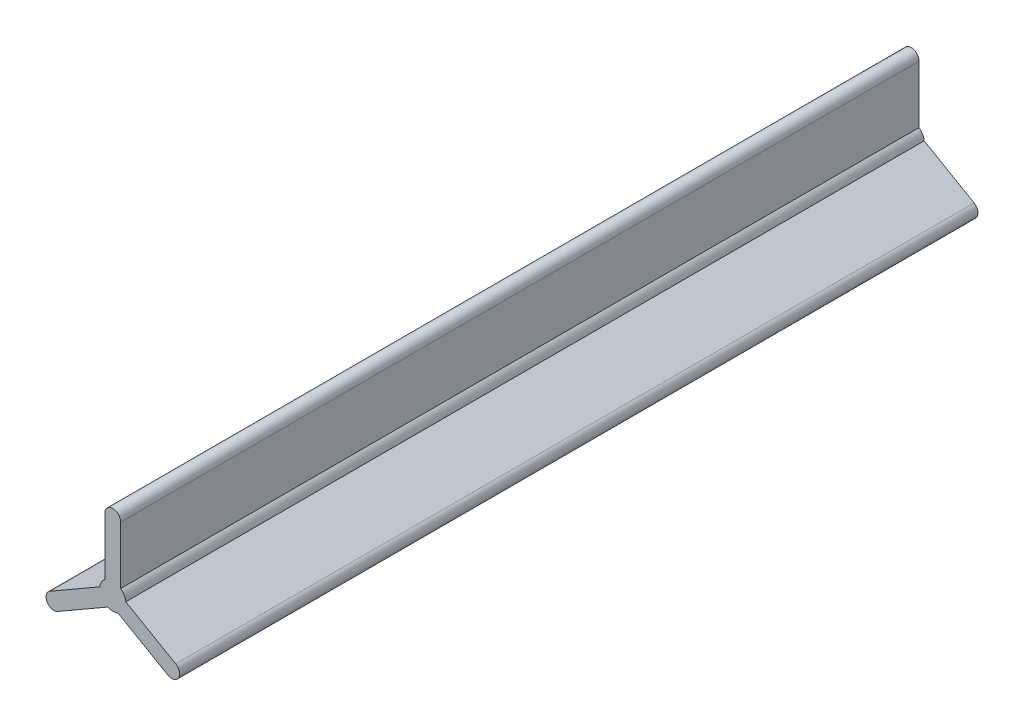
ISO-10303-21;
HEADER;
FILE_DESCRIPTION(('STEP AP214'),'2;1');
FILE_NAME('part.step','',(''),(''),'','','');
FILE_SCHEMA(('AUTOMOTIVE_DESIGN { 1 0 10303 214 1 1 1 1 }'));
ENDSEC;
DATA;
#1=APPLICATION_CONTEXT('core data for automotive mechanical design processes');
#2=APPLICATION_PROTOCOL_DEFINITION('international standard','automotive_design',2000,#1);
#3=PRODUCT_CONTEXT('',#1,'mechanical');
#4=PRODUCT('Part','Part','',(#3));
#5=PRODUCT_RELATED_PRODUCT_CATEGORY('part','',(#4));
#6=PRODUCT_DEFINITION_FORMATION('','',#4);
#7=PRODUCT_DEFINITION_CONTEXT('part definition',#1,'design');
#8=PRODUCT_DEFINITION('design','',#6,#7);
#9=PRODUCT_DEFINITION_SHAPE('','',#8);
#10=(LENGTH_UNIT() NAMED_UNIT(*) SI_UNIT(.MILLI.,.METRE.));
#11=(NAMED_UNIT(*) PLANE_ANGLE_UNIT() SI_UNIT($,.RADIAN.));
#12=(NAMED_UNIT(*) SI_UNIT($,.STERADIAN.) SOLID_ANGLE_UNIT());
#13=UNCERTAINTY_MEASURE_WITH_UNIT(LENGTH_MEASURE(1.E-05),#10,'distance_accuracy_value','');
#14=(GEOMETRIC_REPRESENTATION_CONTEXT(3) GLOBAL_UNCERTAINTY_ASSIGNED_CONTEXT((#13)) GLOBAL_UNIT_ASSIGNED_CONTEXT((#10,
#11,#12)) REPRESENTATION_CONTEXT('',''));
#15=CARTESIAN_POINT('',(0.,0.,0.));
#16=DIRECTION('',(0.,0.,1.));
#17=DIRECTION('',(1.,0.,0.));
#18=AXIS2_PLACEMENT_3D('',#15,#16,#17);
#19=CARTESIAN_POINT('',(0.,0.,305.));
#20=DIRECTION('',(0.,0.,-1.));
#21=DIRECTION('',(-1.,0.,0.));
#22=AXIS2_PLACEMENT_3D('',#19,#20,#21);
#23=CYLINDRICAL_SURFACE('',#22,10.);
#24=DIRECTION('',(0.,0.,-1.));
#25=VECTOR('',#24,1.);
#26=CARTESIAN_POINT('',(9.9282032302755,1.19615242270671,305.));
#27=LINE('',#26,#25);
#28=CARTESIAN_POINT('',(9.9282032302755,1.19615242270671,305.));
#29=VERTEX_POINT('',#28);
#30=CARTESIAN_POINT('',(9.9282032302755,1.19615242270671,-305.));
#31=VERTEX_POINT('',#30);
#32=EDGE_CURVE('E137',#29,#31,#27,.T.);
#33=ORIENTED_EDGE('',*,*,#32,.T.);
#34=CARTESIAN_POINT('',(0.,0.,-305.));
#35=DIRECTION('',(0.,0.,1.));
#36=DIRECTION('',(1.,0.,0.));
#37=AXIS2_PLACEMENT_3D('',#34,#35,#36);
#38=CIRCLE('',#37,10.);
#39=CARTESIAN_POINT('',(5.99999999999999,8.,-305.));
#40=VERTEX_POINT('',#39);
#41=EDGE_CURVE('E237',#31,#40,#38,.T.);
#42=ORIENTED_EDGE('',*,*,#41,.T.);
#43=DIRECTION('',(0.,0.,-1.));
#44=VECTOR('',#43,1.);
#45=CARTESIAN_POINT('',(5.99999999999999,8.00000000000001,305.));
#46=LINE('',#45,#44);
#47=CARTESIAN_POINT('',(5.99999999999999,8.,305.));
#48=VERTEX_POINT('',#47);
#49=EDGE_CURVE('E226',#48,#40,#46,.T.);
#50=ORIENTED_EDGE('',*,*,#49,.F.);
#51=CARTESIAN_POINT('',(0.,0.,305.));
#52=DIRECTION('',(0.,0.,1.));
#53=DIRECTION('',(1.,0.,0.));
#54=AXIS2_PLACEMENT_3D('',#51,#52,#53);
#55=CIRCLE('',#54,10.);
#56=EDGE_CURVE('E49',#29,#48,#55,.T.);
#57=ORIENTED_EDGE('',*,*,#56,.F.);
#58=EDGE_LOOP('',(#33,#42,#50,#57));
#59=FACE_BOUND('',#58,.T.);
#60=ADVANCED_FACE('F39',(#59),#23,.T.);
#61=DIRECTION('',(0.,0.,-1.));
#62=VECTOR('',#61,1.);
#63=CARTESIAN_POINT('',(3.9282032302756,-9.19615242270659,305.));
#64=LINE('',#63,#62);
#65=CARTESIAN_POINT('',(3.9282032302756,-9.19615242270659,305.));
#66=VERTEX_POINT('',#65);
#67=CARTESIAN_POINT('',(3.9282032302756,-9.19615242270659,-305.));
#68=VERTEX_POINT('',#67);
#69=EDGE_CURVE('E63',#66,#68,#64,.T.);
#70=ORIENTED_EDGE('',*,*,#69,.F.);
#71=CARTESIAN_POINT('',(-3.92820323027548,-9.19615242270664,305.));
#72=VERTEX_POINT('',#71);
#73=EDGE_CURVE('E48',#72,#66,#55,.T.);
#74=ORIENTED_EDGE('',*,*,#73,.F.);
#75=DIRECTION('',(0.,0.,-1.));
#76=VECTOR('',#75,1.);
#77=CARTESIAN_POINT('',(-3.92820323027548,-9.19615242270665,305.));
#78=LINE('',#77,#76);
#79=CARTESIAN_POINT('',(-3.92820323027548,-9.19615242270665,-305.));
#80=VERTEX_POINT('',#79);
#81=EDGE_CURVE('E193',#72,#80,#78,.T.);
#82=ORIENTED_EDGE('',*,*,#81,.T.);
#83=EDGE_CURVE('E241',#80,#68,#38,.T.);
#84=ORIENTED_EDGE('',*,*,#83,.T.);
#85=EDGE_LOOP('',(#70,#74,#82,#84));
#86=FACE_BOUND('',#85,.T.);
#87=ADVANCED_FACE('F268',(#86),#23,.T.);
#88=DIRECTION('',(0.,0.,-1.));
#89=VECTOR('',#88,1.);
#90=CARTESIAN_POINT('',(-9.92820323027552,1.19615242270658,305.));
#91=LINE('',#90,#89);
#92=CARTESIAN_POINT('',(-9.92820323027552,1.19615242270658,305.));
#93=VERTEX_POINT('',#92);
#94=CARTESIAN_POINT('',(-9.92820323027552,1.19615242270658,-305.));
#95=VERTEX_POINT('',#94);
#96=EDGE_CURVE('E189',#93,#95,#91,.T.);
#97=ORIENTED_EDGE('',*,*,#96,.F.);
#98=CARTESIAN_POINT('',(-5.99999999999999,8.00000000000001,305.));
#99=VERTEX_POINT('',#98);
#100=EDGE_CURVE('E11',#99,#93,#55,.T.);
#101=ORIENTED_EDGE('',*,*,#100,.F.);
#102=DIRECTION('',(0.,0.,-1.));
#103=VECTOR('',#102,1.);
#104=CARTESIAN_POINT('',(-5.99999999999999,8.00000000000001,305.));
#105=LINE('',#104,#103);
#106=CARTESIAN_POINT('',(-5.99999999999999,8.00000000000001,-305.));
#107=VERTEX_POINT('',#106);
#108=EDGE_CURVE('E230',#99,#107,#105,.T.);
#109=ORIENTED_EDGE('',*,*,#108,.T.);
#110=EDGE_CURVE('E42',#107,#95,#38,.T.);
#111=ORIENTED_EDGE('',*,*,#110,.T.);
#112=EDGE_LOOP('',(#97,#101,#109,#111));
#113=FACE_BOUND('',#112,.T.);
#114=ADVANCED_FACE('F269',(#113),#23,.T.);
#115=CARTESIAN_POINT('',(0.,0.,305.));
#116=DIRECTION('',(0.,0.,1.));
#117=DIRECTION('',(1.,0.,0.));
#118=AXIS2_PLACEMENT_3D('',#115,#116,#117);
#119=PLANE('',#118);
#120=ORIENTED_EDGE('',*,*,#73,.T.);
#121=DIRECTION('',(0.866025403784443,-0.499999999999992,0.));
#122=VECTOR('',#121,1.);
#123=CARTESIAN_POINT('',(3.9282032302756,-9.19615242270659,305.));
#124=LINE('',#123,#122);
#125=CARTESIAN_POINT('',(42.0333209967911,-31.1961524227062,305.));
#126=VERTEX_POINT('',#125);
#127=EDGE_CURVE('E140',#66,#126,#124,.T.);
#128=ORIENTED_EDGE('',*,*,#127,.T.);
#129=CARTESIAN_POINT('',(45.0333209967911,-25.9999999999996,305.));
#130=DIRECTION('',(0.,0.,1.));
#131=DIRECTION('',(-0.499999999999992,-0.866025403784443,0.));
#132=AXIS2_PLACEMENT_3D('',#129,#130,#131);
#133=CIRCLE('',#132,6.);
#134=CARTESIAN_POINT('',(48.033320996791,-20.8038475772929,305.));
#135=VERTEX_POINT('',#134);
#136=EDGE_CURVE('E141',#126,#135,#133,.T.);
#137=ORIENTED_EDGE('',*,*,#136,.T.);
#138=DIRECTION('',(-0.866025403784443,0.499999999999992,0.));
#139=VECTOR('',#138,1.);
#140=CARTESIAN_POINT('',(48.033320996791,-20.8038475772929,305.));
#141=LINE('',#140,#139);
#142=EDGE_CURVE('E130',#135,#29,#141,.T.);
#143=ORIENTED_EDGE('',*,*,#142,.T.);
#144=ORIENTED_EDGE('',*,*,#56,.T.);
#145=DIRECTION('',(0.,1.,0.));
#146=VECTOR('',#145,1.);
#147=CARTESIAN_POINT('',(5.99999999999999,8.00000000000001,305.));
#148=LINE('',#147,#146);
#149=CARTESIAN_POINT('',(6.,52.,305.));
#150=VERTEX_POINT('',#149);
#151=EDGE_CURVE('E211',#48,#150,#148,.T.);
#152=ORIENTED_EDGE('',*,*,#151,.T.);
#153=CARTESIAN_POINT('',(0.,52.,305.));
#154=DIRECTION('',(0.,0.,1.));
#155=DIRECTION('',(1.,0.,0.));
#156=AXIS2_PLACEMENT_3D('',#153,#154,#155);
#157=CIRCLE('',#156,6.);
#158=CARTESIAN_POINT('',(-6.,52.,305.));
#159=VERTEX_POINT('',#158);
#160=EDGE_CURVE('E202',#150,#159,#157,.T.);
#161=ORIENTED_EDGE('',*,*,#160,.T.);
#162=DIRECTION('',(0.,-1.,0.));
#163=VECTOR('',#162,1.);
#164=CARTESIAN_POINT('',(-6.,52.,305.));
#165=LINE('',#164,#163);
#166=EDGE_CURVE('E206',#159,#99,#165,.T.);
#167=ORIENTED_EDGE('',*,*,#166,.T.);
#168=ORIENTED_EDGE('',*,*,#100,.T.);
#169=DIRECTION('',(-0.866025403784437,-0.500000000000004,0.));
#170=VECTOR('',#169,1.);
#171=CARTESIAN_POINT('',(-9.92820323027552,1.19615242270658,305.));
#172=LINE('',#171,#170);
#173=CARTESIAN_POINT('',(-48.0333209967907,-20.8038475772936,305.));
#174=VERTEX_POINT('',#173);
#175=EDGE_CURVE('E177',#93,#174,#172,.T.);
#176=ORIENTED_EDGE('',*,*,#175,.T.);
#177=CARTESIAN_POINT('',(-45.0333209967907,-26.0000000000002,305.));
#178=DIRECTION('',(0.,0.,1.));
#179=DIRECTION('',(-0.500000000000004,0.866025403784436,0.));
#180=AXIS2_PLACEMENT_3D('',#177,#178,#179);
#181=CIRCLE('',#180,6.);
#182=CARTESIAN_POINT('',(-42.0333209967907,-31.1961524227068,305.));
#183=VERTEX_POINT('',#182);
#184=EDGE_CURVE('E168',#174,#183,#181,.T.);
#185=ORIENTED_EDGE('',*,*,#184,.T.);
#186=DIRECTION('',(0.866025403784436,0.500000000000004,0.));
#187=VECTOR('',#186,1.);
#188=CARTESIAN_POINT('',(-42.0333209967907,-31.1961524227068,305.));
#189=LINE('',#188,#187);
#190=EDGE_CURVE('E172',#183,#72,#189,.T.);
#191=ORIENTED_EDGE('',*,*,#190,.T.);
#192=EDGE_LOOP('',(#120,#128,#137,#143,#144,#152,#161,#167,#168,#176,#185,#191));
#193=FACE_BOUND('',#192,.T.);
#194=ADVANCED_FACE('F144',(#193),#119,.T.);
#195=CARTESIAN_POINT('',(0.,0.,-305.));
#196=DIRECTION('',(0.,0.,1.));
#197=DIRECTION('',(1.,0.,0.));
#198=AXIS2_PLACEMENT_3D('',#195,#196,#197);
#199=PLANE('',#198);
#200=ORIENTED_EDGE('',*,*,#41,.F.);
#201=DIRECTION('',(-0.866025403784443,0.499999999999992,0.));
#202=VECTOR('',#201,1.);
#203=CARTESIAN_POINT('',(48.033320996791,-20.8038475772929,-305.));
#204=LINE('',#203,#202);
#205=CARTESIAN_POINT('',(48.033320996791,-20.8038475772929,-305.));
#206=VERTEX_POINT('',#205);
#207=EDGE_CURVE('E258',#206,#31,#204,.T.);
#208=ORIENTED_EDGE('',*,*,#207,.F.);
#209=CARTESIAN_POINT('',(45.0333209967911,-25.9999999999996,-305.));
#210=DIRECTION('',(0.,0.,1.));
#211=DIRECTION('',(-0.499999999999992,-0.866025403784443,0.));
#212=AXIS2_PLACEMENT_3D('',#209,#210,#211);
#213=CIRCLE('',#212,6.);
#214=CARTESIAN_POINT('',(42.0333209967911,-31.1961524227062,-305.));
#215=VERTEX_POINT('',#214);
#216=EDGE_CURVE('E154',#215,#206,#213,.T.);
#217=ORIENTED_EDGE('',*,*,#216,.F.);
#218=DIRECTION('',(0.866025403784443,-0.499999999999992,0.));
#219=VECTOR('',#218,1.);
#220=CARTESIAN_POINT('',(3.9282032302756,-9.19615242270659,-305.));
#221=LINE('',#220,#219);
#222=EDGE_CURVE('E150',#68,#215,#221,.T.);
#223=ORIENTED_EDGE('',*,*,#222,.F.);
#224=ORIENTED_EDGE('',*,*,#83,.F.);
#225=DIRECTION('',(0.866025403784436,0.500000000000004,0.));
#226=VECTOR('',#225,1.);
#227=CARTESIAN_POINT('',(-42.0333209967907,-31.1961524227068,-305.));
#228=LINE('',#227,#226);
#229=CARTESIAN_POINT('',(-42.0333209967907,-31.1961524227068,-305.));
#230=VERTEX_POINT('',#229);
#231=EDGE_CURVE('E162',#230,#80,#228,.T.);
#232=ORIENTED_EDGE('',*,*,#231,.F.);
#233=CARTESIAN_POINT('',(-45.0333209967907,-26.0000000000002,-305.));
#234=DIRECTION('',(0.,0.,1.));
#235=DIRECTION('',(-0.500000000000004,0.866025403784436,0.));
#236=AXIS2_PLACEMENT_3D('',#233,#234,#235);
#237=CIRCLE('',#236,6.);
#238=CARTESIAN_POINT('',(-48.0333209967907,-20.8038475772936,-305.));
#239=VERTEX_POINT('',#238);
#240=EDGE_CURVE('E156',#239,#230,#237,.T.);
#241=ORIENTED_EDGE('',*,*,#240,.F.);
#242=DIRECTION('',(-0.866025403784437,-0.500000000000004,0.));
#243=VECTOR('',#242,1.);
#244=CARTESIAN_POINT('',(-9.92820323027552,1.19615242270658,-305.));
#245=LINE('',#244,#243);
#246=EDGE_CURVE('E173',#95,#239,#245,.T.);
#247=ORIENTED_EDGE('',*,*,#246,.F.);
#248=ORIENTED_EDGE('',*,*,#110,.F.);
#249=DIRECTION('',(0.,-1.,0.));
#250=VECTOR('',#249,1.);
#251=CARTESIAN_POINT('',(-6.,52.,-305.));
#252=LINE('',#251,#250);
#253=CARTESIAN_POINT('',(-6.,52.,-305.));
#254=VERTEX_POINT('',#253);
#255=EDGE_CURVE('E217',#254,#107,#252,.T.);
#256=ORIENTED_EDGE('',*,*,#255,.F.);
#257=CARTESIAN_POINT('',(0.,52.,-305.));
#258=DIRECTION('',(0.,0.,1.));
#259=DIRECTION('',(1.,0.,0.));
#260=AXIS2_PLACEMENT_3D('',#257,#258,#259);
#261=CIRCLE('',#260,6.);
#262=CARTESIAN_POINT('',(6.,52.,-305.));
#263=VERTEX_POINT('',#262);
#264=EDGE_CURVE('E201',#263,#254,#261,.T.);
#265=ORIENTED_EDGE('',*,*,#264,.F.);
#266=DIRECTION('',(0.,1.,0.));
#267=VECTOR('',#266,1.);
#268=CARTESIAN_POINT('',(5.99999999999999,8.00000000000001,-305.));
#269=LINE('',#268,#267);
#270=EDGE_CURVE('E207',#40,#263,#269,.T.);
#271=ORIENTED_EDGE('',*,*,#270,.F.);
#272=EDGE_LOOP('',(#200,#208,#217,#223,#224,#232,#241,#247,#248,#256,#265,#271));
#273=FACE_BOUND('',#272,.T.);
#274=ADVANCED_FACE('F264',(#273),#199,.F.);
#275=CARTESIAN_POINT('',(0.,52.,305.));
#276=DIRECTION('',(0.,0.,-1.));
#277=DIRECTION('',(-1.,0.,0.));
#278=AXIS2_PLACEMENT_3D('',#275,#276,#277);
#279=CYLINDRICAL_SURFACE('',#278,6.);
#280=ORIENTED_EDGE('',*,*,#264,.T.);
#281=DIRECTION('',(0.,0.,-1.));
#282=VECTOR('',#281,1.);
#283=CARTESIAN_POINT('',(-6.,52.,305.));
#284=LINE('',#283,#282);
#285=EDGE_CURVE('E234',#159,#254,#284,.T.);
#286=ORIENTED_EDGE('',*,*,#285,.F.);
#287=ORIENTED_EDGE('',*,*,#160,.F.);
#288=DIRECTION('',(0.,0.,-1.));
#289=VECTOR('',#288,1.);
#290=CARTESIAN_POINT('',(6.,52.,305.));
#291=LINE('',#290,#289);
#292=EDGE_CURVE('E213',#150,#263,#291,.T.);
#293=ORIENTED_EDGE('',*,*,#292,.T.);
#294=EDGE_LOOP('',(#280,#286,#287,#293));
#295=FACE_BOUND('',#294,.T.);
#296=ADVANCED_FACE('F294',(#295),#279,.T.);
#297=CARTESIAN_POINT('',(-6.,52.,305.));
#298=DIRECTION('',(1.,0.,0.));
#299=DIRECTION('',(0.,1.,0.));
#300=AXIS2_PLACEMENT_3D('',#297,#298,#299);
#301=PLANE('',#300);
#302=ORIENTED_EDGE('',*,*,#255,.T.);
#303=ORIENTED_EDGE('',*,*,#108,.F.);
#304=ORIENTED_EDGE('',*,*,#166,.F.);
#305=ORIENTED_EDGE('',*,*,#285,.T.);
#306=EDGE_LOOP('',(#302,#303,#304,#305));
#307=FACE_BOUND('',#306,.T.);
#308=ADVANCED_FACE('F291',(#307),#301,.F.);
#309=CARTESIAN_POINT('',(5.99999999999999,8.00000000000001,305.));
#310=DIRECTION('',(-1.,0.,0.));
#311=DIRECTION('',(0.,-1.,0.));
#312=AXIS2_PLACEMENT_3D('',#309,#310,#311);
#313=PLANE('',#312);
#314=ORIENTED_EDGE('',*,*,#270,.T.);
#315=ORIENTED_EDGE('',*,*,#292,.F.);
#316=ORIENTED_EDGE('',*,*,#151,.F.);
#317=ORIENTED_EDGE('',*,*,#49,.T.);
#318=EDGE_LOOP('',(#314,#315,#316,#317));
#319=FACE_BOUND('',#318,.T.);
#320=ADVANCED_FACE('F293',(#319),#313,.F.);
#321=CARTESIAN_POINT('',(-45.0333209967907,-26.0000000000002,305.));
#322=DIRECTION('',(0.,0.,-1.));
#323=DIRECTION('',(-1.,0.,0.));
#324=AXIS2_PLACEMENT_3D('',#321,#322,#323);
#325=CYLINDRICAL_SURFACE('',#324,6.);
#326=ORIENTED_EDGE('',*,*,#240,.T.);
#327=DIRECTION('',(0.,0.,-1.));
#328=VECTOR('',#327,1.);
#329=CARTESIAN_POINT('',(-42.0333209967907,-31.1961524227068,305.));
#330=LINE('',#329,#328);
#331=EDGE_CURVE('E197',#183,#230,#330,.T.);
#332=ORIENTED_EDGE('',*,*,#331,.F.);
#333=ORIENTED_EDGE('',*,*,#184,.F.);
#334=DIRECTION('',(0.,0.,-1.));
#335=VECTOR('',#334,1.);
#336=CARTESIAN_POINT('',(-48.0333209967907,-20.8038475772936,305.));
#337=LINE('',#336,#335);
#338=EDGE_CURVE('E179',#174,#239,#337,.T.);
#339=ORIENTED_EDGE('',*,*,#338,.T.);
#340=EDGE_LOOP('',(#326,#332,#333,#339));
#341=FACE_BOUND('',#340,.T.);
#342=ADVANCED_FACE('F288',(#341),#325,.T.);
#343=CARTESIAN_POINT('',(-42.0333209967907,-31.1961524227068,305.));
#344=DIRECTION('',(-0.500000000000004,0.866025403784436,0.));
#345=DIRECTION('',(-0.866025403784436,-0.500000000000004,0.));
#346=AXIS2_PLACEMENT_3D('',#343,#344,#345);
#347=PLANE('',#346);
#348=ORIENTED_EDGE('',*,*,#231,.T.);
#349=ORIENTED_EDGE('',*,*,#81,.F.);
#350=ORIENTED_EDGE('',*,*,#190,.F.);
#351=ORIENTED_EDGE('',*,*,#331,.T.);
#352=EDGE_LOOP('',(#348,#349,#350,#351));
#353=FACE_BOUND('',#352,.T.);
#354=ADVANCED_FACE('F290',(#353),#347,.F.);
#355=CARTESIAN_POINT('',(-9.92820323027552,1.19615242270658,305.));
#356=DIRECTION('',(0.500000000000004,-0.866025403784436,0.));
#357=DIRECTION('',(0.866025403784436,0.500000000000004,0.));
#358=AXIS2_PLACEMENT_3D('',#355,#356,#357);
#359=PLANE('',#358);
#360=ORIENTED_EDGE('',*,*,#246,.T.);
#361=ORIENTED_EDGE('',*,*,#338,.F.);
#362=ORIENTED_EDGE('',*,*,#175,.F.);
#363=ORIENTED_EDGE('',*,*,#96,.T.);
#364=EDGE_LOOP('',(#360,#361,#362,#363));
#365=FACE_BOUND('',#364,.T.);
#366=ADVANCED_FACE('F283',(#365),#359,.F.);
#367=CARTESIAN_POINT('',(45.0333209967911,-25.9999999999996,305.));
#368=DIRECTION('',(0.,0.,-1.));
#369=DIRECTION('',(-1.,0.,0.));
#370=AXIS2_PLACEMENT_3D('',#367,#368,#369);
#371=CYLINDRICAL_SURFACE('',#370,6.);
#372=ORIENTED_EDGE('',*,*,#216,.T.);
#373=DIRECTION('',(0.,0.,-1.));
#374=VECTOR('',#373,1.);
#375=CARTESIAN_POINT('',(48.033320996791,-20.8038475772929,305.));
#376=LINE('',#375,#374);
#377=EDGE_CURVE('E135',#135,#206,#376,.T.);
#378=ORIENTED_EDGE('',*,*,#377,.F.);
#379=ORIENTED_EDGE('',*,*,#136,.F.);
#380=DIRECTION('',(0.,0.,-1.));
#381=VECTOR('',#380,1.);
#382=CARTESIAN_POINT('',(42.0333209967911,-31.1961524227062,305.));
#383=LINE('',#382,#381);
#384=EDGE_CURVE('E251',#126,#215,#383,.T.);
#385=ORIENTED_EDGE('',*,*,#384,.T.);
#386=EDGE_LOOP('',(#372,#378,#379,#385));
#387=FACE_BOUND('',#386,.T.);
#388=ADVANCED_FACE('F152',(#387),#371,.T.);
#389=CARTESIAN_POINT('',(48.033320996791,-20.8038475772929,305.));
#390=DIRECTION('',(-0.499999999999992,-0.866025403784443,0.));
#391=DIRECTION('',(0.866025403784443,-0.499999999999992,0.));
#392=AXIS2_PLACEMENT_3D('',#389,#390,#391);
#393=PLANE('',#392);
#394=ORIENTED_EDGE('',*,*,#207,.T.);
#395=ORIENTED_EDGE('',*,*,#32,.F.);
#396=ORIENTED_EDGE('',*,*,#142,.F.);
#397=ORIENTED_EDGE('',*,*,#377,.T.);
#398=EDGE_LOOP('',(#394,#395,#396,#397));
#399=FACE_BOUND('',#398,.T.);
#400=ADVANCED_FACE('F133',(#399),#393,.F.);
#401=CARTESIAN_POINT('',(3.9282032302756,-9.19615242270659,305.));
#402=DIRECTION('',(0.499999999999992,0.866025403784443,0.));
#403=DIRECTION('',(-0.866025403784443,0.499999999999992,0.));
#404=AXIS2_PLACEMENT_3D('',#401,#402,#403);
#405=PLANE('',#404);
#406=ORIENTED_EDGE('',*,*,#222,.T.);
#407=ORIENTED_EDGE('',*,*,#384,.F.);
#408=ORIENTED_EDGE('',*,*,#127,.F.);
#409=ORIENTED_EDGE('',*,*,#69,.T.);
#410=EDGE_LOOP('',(#406,#407,#408,#409));
#411=FACE_BOUND('',#410,.T.);
#412=ADVANCED_FACE('F249',(#411),#405,.F.);
#413=CLOSED_SHELL('',(#60,#87,#114,#194,#274,#296,#308,#320,#342,#354,#366,#388,#400,#412));
#414=MANIFOLD_SOLID_BREP('B2',#413);
#415=ADVANCED_BREP_SHAPE_REPRESENTATION('',(#18,#414),#14);
#416=SHAPE_DEFINITION_REPRESENTATION(#9,#415);
ENDSEC;
END-ISO-10303-21;
